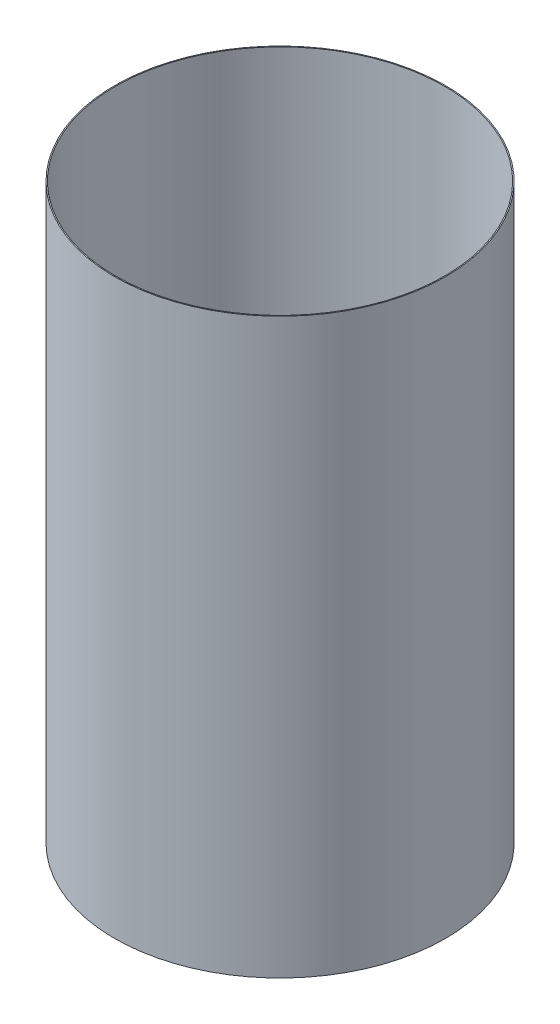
from build123d import *

# Parameters (mm, degrees)
ESQUISSE1_R        = 48.8
ESQUISSE1_R_2      = 48.5
EXTRU_MINCE1_DEPTH = 169


with BuildPart() as part:
    # Esquisse1 → Extru.-Mince1 (new body)
    with BuildSketch(Plane(origin=(0, 0, 0), x_dir=(1, 0, 0), z_dir=(0, 1, 0))):
        Circle(ESQUISSE1_R)
        Circle(ESQUISSE1_R_2, mode=Mode.SUBTRACT)
    extrude(amount=EXTRU_MINCE1_DEPTH)


solid = part.part
